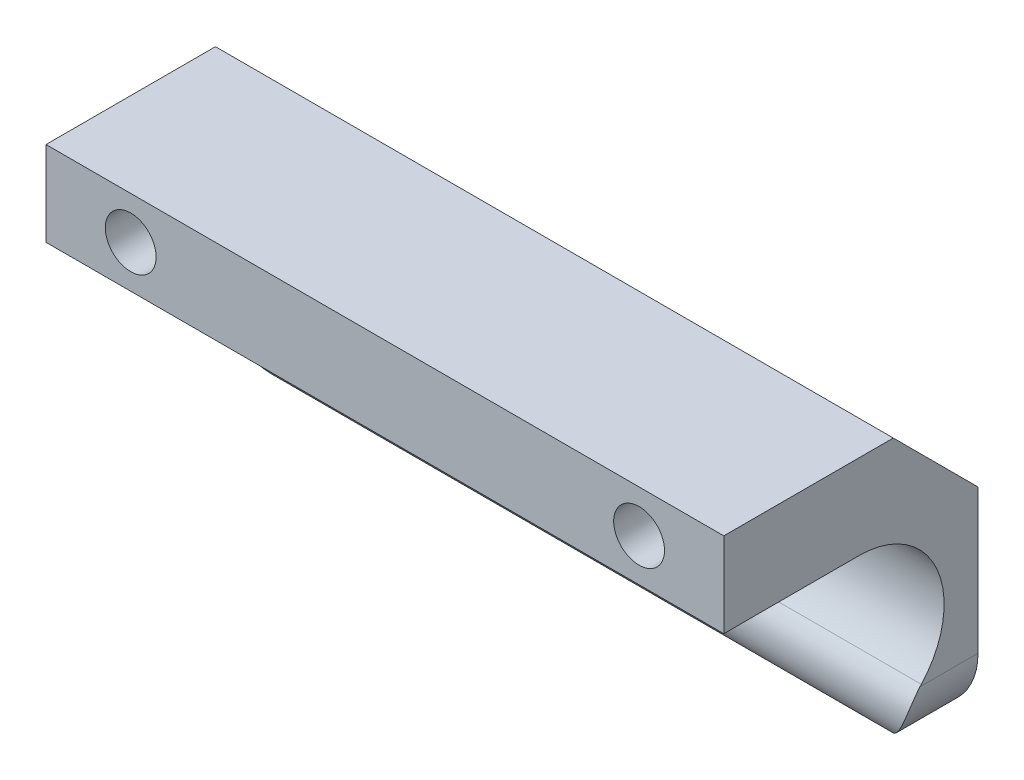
ISO-10303-21;
HEADER;
FILE_DESCRIPTION(('STEP AP214'),'2;1');
FILE_NAME('part.step','',(''),(''),'','','');
FILE_SCHEMA(('AUTOMOTIVE_DESIGN { 1 0 10303 214 1 1 1 1 }'));
ENDSEC;
DATA;
#1=APPLICATION_CONTEXT('core data for automotive mechanical design processes');
#2=APPLICATION_PROTOCOL_DEFINITION('international standard','automotive_design',2000,#1);
#3=PRODUCT_CONTEXT('',#1,'mechanical');
#4=PRODUCT('Part','Part','',(#3));
#5=PRODUCT_RELATED_PRODUCT_CATEGORY('part','',(#4));
#6=PRODUCT_DEFINITION_FORMATION('','',#4);
#7=PRODUCT_DEFINITION_CONTEXT('part definition',#1,'design');
#8=PRODUCT_DEFINITION('design','',#6,#7);
#9=PRODUCT_DEFINITION_SHAPE('','',#8);
#10=(LENGTH_UNIT() NAMED_UNIT(*) SI_UNIT(.MILLI.,.METRE.));
#11=(NAMED_UNIT(*) PLANE_ANGLE_UNIT() SI_UNIT($,.RADIAN.));
#12=(NAMED_UNIT(*) SI_UNIT($,.STERADIAN.) SOLID_ANGLE_UNIT());
#13=UNCERTAINTY_MEASURE_WITH_UNIT(LENGTH_MEASURE(1.E-05),#10,'distance_accuracy_value','');
#14=(GEOMETRIC_REPRESENTATION_CONTEXT(3) GLOBAL_UNCERTAINTY_ASSIGNED_CONTEXT((#13)) GLOBAL_UNIT_ASSIGNED_CONTEXT((#10,
#11,#12)) REPRESENTATION_CONTEXT('',''));
#15=CARTESIAN_POINT('',(0.,0.,0.));
#16=DIRECTION('',(0.,0.,1.));
#17=DIRECTION('',(1.,0.,0.));
#18=AXIS2_PLACEMENT_3D('',#15,#16,#17);
#19=CARTESIAN_POINT('',(-40.,17.5,-15.));
#20=DIRECTION('',(-1.,0.,0.));
#21=DIRECTION('',(0.,0.,1.));
#22=AXIS2_PLACEMENT_3D('',#19,#20,#21);
#23=PLANE('',#22);
#24=DIRECTION('',(0.,1.,0.));
#25=VECTOR('',#24,1.);
#26=CARTESIAN_POINT('',(-40.,-17.5,-15.));
#27=LINE('',#26,#25);
#28=CARTESIAN_POINT('',(-40.,-9.5,-15.));
#29=VERTEX_POINT('',#28);
#30=CARTESIAN_POINT('',(-40.,7.49999999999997,-15.));
#31=VERTEX_POINT('',#30);
#32=EDGE_CURVE('E203',#29,#31,#27,.T.);
#33=ORIENTED_EDGE('',*,*,#32,.F.);
#34=DIRECTION('',(0.,0.,-1.));
#35=VECTOR('',#34,1.);
#36=CARTESIAN_POINT('',(-40.,-9.5,15.));
#37=LINE('',#36,#35);
#38=CARTESIAN_POINT('',(-40.,-9.5,-8.15302564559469));
#39=VERTEX_POINT('',#38);
#40=EDGE_CURVE('E163',#39,#29,#37,.T.);
#41=ORIENTED_EDGE('',*,*,#40,.F.);
#42=CARTESIAN_POINT('',(-40.,-12.642135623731,-11.857864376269));
#43=DIRECTION('',(1.,0.,0.));
#44=DIRECTION('',(0.,0.,-1.));
#45=AXIS2_PLACEMENT_3D('',#42,#43,#44);
#46=CIRCLE('',#45,4.85786437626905);
#47=CARTESIAN_POINT('',(-40.,-9.32610593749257,-8.30782305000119));
#48=VERTEX_POINT('',#47);
#49=EDGE_CURVE('E177',#48,#39,#46,.T.);
#50=ORIENTED_EDGE('',*,*,#49,.F.);
#51=CARTESIAN_POINT('',(-40.,-2.5,-0.999999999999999));
#52=DIRECTION('',(1.,0.,0.));
#53=DIRECTION('',(0.,0.,-1.));
#54=AXIS2_PLACEMENT_3D('',#51,#52,#53);
#55=CIRCLE('',#54,10.);
#56=CARTESIAN_POINT('',(-40.,7.5,-1.));
#57=VERTEX_POINT('',#56);
#58=EDGE_CURVE('E181',#48,#57,#55,.T.);
#59=ORIENTED_EDGE('',*,*,#58,.T.);
#60=DIRECTION('',(0.,0.,1.));
#61=VECTOR('',#60,1.);
#62=CARTESIAN_POINT('',(-40.,7.5,-35.9970345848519));
#63=LINE('',#62,#61);
#64=CARTESIAN_POINT('',(-40.,7.5,15.));
#65=VERTEX_POINT('',#64);
#66=EDGE_CURVE('E186',#57,#65,#63,.T.);
#67=ORIENTED_EDGE('',*,*,#66,.T.);
#68=DIRECTION('',(0.,-1.,0.));
#69=VECTOR('',#68,1.);
#70=CARTESIAN_POINT('',(-40.,-17.5,15.));
#71=LINE('',#70,#69);
#72=CARTESIAN_POINT('',(-40.,17.5,15.));
#73=VERTEX_POINT('',#72);
#74=EDGE_CURVE('E213',#73,#65,#71,.T.);
#75=ORIENTED_EDGE('',*,*,#74,.F.);
#76=DIRECTION('',(0.,0.,1.));
#77=VECTOR('',#76,1.);
#78=CARTESIAN_POINT('',(-40.,17.5,15.));
#79=LINE('',#78,#77);
#80=CARTESIAN_POINT('',(-40.,17.5,-5.00000000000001));
#81=VERTEX_POINT('',#80);
#82=EDGE_CURVE('E223',#81,#73,#79,.T.);
#83=ORIENTED_EDGE('',*,*,#82,.F.);
#84=DIRECTION('',(0.,0.707106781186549,0.707106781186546));
#85=VECTOR('',#84,1.);
#86=CARTESIAN_POINT('',(-40.,12.5,-9.99999999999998));
#87=LINE('',#86,#85);
#88=EDGE_CURVE('E236',#81,#31,#87,.F.);
#89=ORIENTED_EDGE('',*,*,#88,.T.);
#90=EDGE_LOOP('',(#33,#41,#50,#59,#67,#75,#83,#89));
#91=FACE_BOUND('',#90,.T.);
#92=ADVANCED_FACE('F37',(#91),#23,.T.);
#93=CARTESIAN_POINT('',(40.,17.5,-15.));
#94=DIRECTION('',(-1.,0.,0.));
#95=DIRECTION('',(0.,0.,1.));
#96=AXIS2_PLACEMENT_3D('',#93,#94,#95);
#97=PLANE('',#96);
#98=DIRECTION('',(0.,0.,-1.));
#99=VECTOR('',#98,1.);
#100=CARTESIAN_POINT('',(40.,-9.5,15.));
#101=LINE('',#100,#99);
#102=CARTESIAN_POINT('',(40.,-9.5,-8.15302564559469));
#103=VERTEX_POINT('',#102);
#104=CARTESIAN_POINT('',(40.,-9.5,-15.));
#105=VERTEX_POINT('',#104);
#106=EDGE_CURVE('E169',#103,#105,#101,.T.);
#107=ORIENTED_EDGE('',*,*,#106,.T.);
#108=DIRECTION('',(0.,1.,0.));
#109=VECTOR('',#108,1.);
#110=CARTESIAN_POINT('',(40.,-17.5,-15.));
#111=LINE('',#110,#109);
#112=CARTESIAN_POINT('',(40.,7.49999999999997,-15.));
#113=VERTEX_POINT('',#112);
#114=EDGE_CURVE('E209',#105,#113,#111,.T.);
#115=ORIENTED_EDGE('',*,*,#114,.T.);
#116=DIRECTION('',(0.,-0.707106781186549,-0.707106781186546));
#117=VECTOR('',#116,1.);
#118=CARTESIAN_POINT('',(40.,17.5,-5.));
#119=LINE('',#118,#117);
#120=CARTESIAN_POINT('',(40.,17.5,-5.00000000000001));
#121=VERTEX_POINT('',#120);
#122=EDGE_CURVE('E244',#113,#121,#119,.F.);
#123=ORIENTED_EDGE('',*,*,#122,.T.);
#124=DIRECTION('',(0.,0.,1.));
#125=VECTOR('',#124,1.);
#126=CARTESIAN_POINT('',(40.,17.5,15.));
#127=LINE('',#126,#125);
#128=CARTESIAN_POINT('',(40.,17.5,15.));
#129=VERTEX_POINT('',#128);
#130=EDGE_CURVE('E212',#121,#129,#127,.T.);
#131=ORIENTED_EDGE('',*,*,#130,.T.);
#132=DIRECTION('',(0.,-1.,0.));
#133=VECTOR('',#132,1.);
#134=CARTESIAN_POINT('',(40.,-17.5,15.));
#135=LINE('',#134,#133);
#136=CARTESIAN_POINT('',(40.,7.5,15.));
#137=VERTEX_POINT('',#136);
#138=EDGE_CURVE('E216',#129,#137,#135,.T.);
#139=ORIENTED_EDGE('',*,*,#138,.T.);
#140=DIRECTION('',(0.,0.,1.));
#141=VECTOR('',#140,1.);
#142=CARTESIAN_POINT('',(40.,7.5,-35.9970345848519));
#143=LINE('',#142,#141);
#144=CARTESIAN_POINT('',(40.,7.5,-1.));
#145=VERTEX_POINT('',#144);
#146=EDGE_CURVE('E182',#145,#137,#143,.T.);
#147=ORIENTED_EDGE('',*,*,#146,.F.);
#148=CARTESIAN_POINT('',(40.,-2.5,-0.999999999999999));
#149=DIRECTION('',(1.,0.,0.));
#150=DIRECTION('',(0.,0.,-1.));
#151=AXIS2_PLACEMENT_3D('',#148,#149,#150);
#152=CIRCLE('',#151,10.);
#153=CARTESIAN_POINT('',(40.,-9.32610593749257,-8.30782305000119));
#154=VERTEX_POINT('',#153);
#155=EDGE_CURVE('E194',#154,#145,#152,.T.);
#156=ORIENTED_EDGE('',*,*,#155,.F.);
#157=CARTESIAN_POINT('',(40.,-12.642135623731,-11.857864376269));
#158=DIRECTION('',(1.,0.,0.));
#159=DIRECTION('',(0.,0.,-1.));
#160=AXIS2_PLACEMENT_3D('',#157,#158,#159);
#161=CIRCLE('',#160,4.85786437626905);
#162=EDGE_CURVE('E176',#154,#103,#161,.T.);
#163=ORIENTED_EDGE('',*,*,#162,.T.);
#164=EDGE_LOOP('',(#107,#115,#123,#131,#139,#147,#156,#163));
#165=FACE_BOUND('',#164,.T.);
#166=ADVANCED_FACE('F267',(#165),#97,.F.);
#167=CARTESIAN_POINT('',(40.,-17.5,-15.));
#168=DIRECTION('',(0.,0.,1.));
#169=DIRECTION('',(1.,0.,0.));
#170=AXIS2_PLACEMENT_3D('',#167,#168,#169);
#171=PLANE('',#170);
#172=DIRECTION('',(1.,0.,0.));
#173=VECTOR('',#172,1.);
#174=CARTESIAN_POINT('',(-40.,-16.3469743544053,-15.));
#175=LINE('',#174,#173);
#176=CARTESIAN_POINT('',(-36.1375043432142,-16.3469743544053,-15.));
#177=VERTEX_POINT('',#176);
#178=CARTESIAN_POINT('',(36.1375043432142,-16.3469743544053,-15.));
#179=VERTEX_POINT('',#178);
#180=EDGE_CURVE('E173',#177,#179,#175,.T.);
#181=ORIENTED_EDGE('',*,*,#180,.F.);
#182=CARTESIAN_POINT('',(-32.,-9.5,-15.));
#183=DIRECTION('',(0.,0.,1.));
#184=DIRECTION('',(-1.,0.,0.));
#185=AXIS2_PLACEMENT_3D('',#182,#183,#184);
#186=CIRCLE('',#185,8.);
#187=EDGE_CURVE('E160',#29,#177,#186,.T.);
#188=ORIENTED_EDGE('',*,*,#187,.F.);
#189=ORIENTED_EDGE('',*,*,#32,.T.);
#190=DIRECTION('',(1.,0.,0.));
#191=VECTOR('',#190,1.);
#192=CARTESIAN_POINT('',(40.,7.49999999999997,-15.));
#193=LINE('',#192,#191);
#194=EDGE_CURVE('E240',#31,#113,#193,.T.);
#195=ORIENTED_EDGE('',*,*,#194,.T.);
#196=ORIENTED_EDGE('',*,*,#114,.F.);
#197=CARTESIAN_POINT('',(32.,-9.5,-15.));
#198=DIRECTION('',(0.,0.,1.));
#199=DIRECTION('',(-1.,0.,0.));
#200=AXIS2_PLACEMENT_3D('',#197,#198,#199);
#201=CIRCLE('',#200,8.);
#202=EDGE_CURVE('E166',#179,#105,#201,.T.);
#203=ORIENTED_EDGE('',*,*,#202,.F.);
#204=EDGE_LOOP('',(#181,#188,#189,#195,#196,#203));
#205=FACE_BOUND('',#204,.T.);
#206=ADVANCED_FACE('F314',(#205),#171,.F.);
#207=CARTESIAN_POINT('',(40.,17.5,15.));
#208=DIRECTION('',(0.,-1.,0.));
#209=DIRECTION('',(0.,0.,-1.));
#210=AXIS2_PLACEMENT_3D('',#207,#208,#209);
#211=PLANE('',#210);
#212=ORIENTED_EDGE('',*,*,#130,.F.);
#213=DIRECTION('',(-1.,0.,0.));
#214=VECTOR('',#213,1.);
#215=CARTESIAN_POINT('',(40.,17.5,-5.));
#216=LINE('',#215,#214);
#217=EDGE_CURVE('E232',#121,#81,#216,.T.);
#218=ORIENTED_EDGE('',*,*,#217,.T.);
#219=ORIENTED_EDGE('',*,*,#82,.T.);
#220=DIRECTION('',(-1.,0.,0.));
#221=VECTOR('',#220,1.);
#222=CARTESIAN_POINT('',(40.,17.5,15.));
#223=LINE('',#222,#221);
#224=EDGE_CURVE('E220',#129,#73,#223,.T.);
#225=ORIENTED_EDGE('',*,*,#224,.F.);
#226=EDGE_LOOP('',(#212,#218,#219,#225));
#227=FACE_BOUND('',#226,.T.);
#228=ADVANCED_FACE('F321',(#227),#211,.F.);
#229=CARTESIAN_POINT('',(40.,-17.5,15.));
#230=DIRECTION('',(0.,0.,-1.));
#231=DIRECTION('',(-1.,0.,0.));
#232=AXIS2_PLACEMENT_3D('',#229,#230,#231);
#233=PLANE('',#232);
#234=CARTESIAN_POINT('',(30.,12.5,15.));
#235=DIRECTION('',(0.,0.,1.));
#236=DIRECTION('',(1.,0.,0.));
#237=AXIS2_PLACEMENT_3D('',#234,#235,#236);
#238=CIRCLE('',#237,3.);
#239=CARTESIAN_POINT('',(33.,12.5,15.));
#240=VERTEX_POINT('',#239);
#241=EDGE_CURVE('E353',#240,#240,#238,.T.);
#242=ORIENTED_EDGE('',*,*,#241,.F.);
#243=EDGE_LOOP('',(#242));
#244=FACE_BOUND('',#243,.T.);
#245=CARTESIAN_POINT('',(-30.,12.5,15.));
#246=DIRECTION('',(0.,0.,1.));
#247=DIRECTION('',(1.,0.,0.));
#248=AXIS2_PLACEMENT_3D('',#245,#246,#247);
#249=CIRCLE('',#248,3.);
#250=CARTESIAN_POINT('',(-27.,12.5,15.));
#251=VERTEX_POINT('',#250);
#252=EDGE_CURVE('E134',#251,#251,#249,.T.);
#253=ORIENTED_EDGE('',*,*,#252,.F.);
#254=EDGE_LOOP('',(#253));
#255=FACE_BOUND('',#254,.T.);
#256=ORIENTED_EDGE('',*,*,#74,.T.);
#257=DIRECTION('',(1.,0.,0.));
#258=VECTOR('',#257,1.);
#259=CARTESIAN_POINT('',(-40.,7.5,15.));
#260=LINE('',#259,#258);
#261=EDGE_CURVE('E200',#65,#137,#260,.T.);
#262=ORIENTED_EDGE('',*,*,#261,.T.);
#263=ORIENTED_EDGE('',*,*,#138,.F.);
#264=ORIENTED_EDGE('',*,*,#224,.T.);
#265=EDGE_LOOP('',(#256,#262,#263,#264));
#266=FACE_BOUND('',#265,.T.);
#267=ADVANCED_FACE('F318',(#244,#255,#266),#233,.F.);
#268=CARTESIAN_POINT('',(40.,17.5,-5.));
#269=DIRECTION('',(0.,-0.707106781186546,0.707106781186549));
#270=DIRECTION('',(0.,-0.707106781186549,-0.707106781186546));
#271=AXIS2_PLACEMENT_3D('',#268,#269,#270);
#272=PLANE('',#271);
#273=ORIENTED_EDGE('',*,*,#122,.F.);
#274=ORIENTED_EDGE('',*,*,#194,.F.);
#275=ORIENTED_EDGE('',*,*,#88,.F.);
#276=ORIENTED_EDGE('',*,*,#217,.F.);
#277=EDGE_LOOP('',(#273,#274,#275,#276));
#278=FACE_BOUND('',#277,.T.);
#279=ADVANCED_FACE('F39',(#278),#272,.F.);
#280=CARTESIAN_POINT('',(-40.,-12.642135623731,-11.857864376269));
#281=DIRECTION('',(1.,0.,0.));
#282=DIRECTION('',(0.,0.,-1.));
#283=AXIS2_PLACEMENT_3D('',#280,#281,#282);
#284=CYLINDRICAL_SURFACE('',#283,4.85786437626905);
#285=CARTESIAN_POINT('',(-36.1375043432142,-16.3469743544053,-15.));
#286=CARTESIAN_POINT('',(-36.0261493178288,-16.4142592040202,-14.9206561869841));
#287=CARTESIAN_POINT('',(-35.9139235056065,-16.4783721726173,-14.8399052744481));
#288=CARTESIAN_POINT('',(-35.6879480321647,-16.6003901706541,-14.6759350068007));
#289=CARTESIAN_POINT('',(-35.5741986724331,-16.6582964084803,-14.5927161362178));
#290=CARTESIAN_POINT('',(-35.2311071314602,-16.8228592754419,-14.3399621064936));
#291=CARTESIAN_POINT('',(-34.9997446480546,-16.9204660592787,-14.1672029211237));
#292=CARTESIAN_POINT('',(-34.5341663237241,-17.0920563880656,-13.8161969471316));
#293=CARTESIAN_POINT('',(-34.2999657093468,-17.1661334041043,-13.6379750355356));
#294=CARTESIAN_POINT('',(-33.8289391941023,-17.2919435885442,-13.2772338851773));
#295=CARTESIAN_POINT('',(-33.5921135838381,-17.3436792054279,-13.0947151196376));
#296=CARTESIAN_POINT('',(-33.1319730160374,-17.422727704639,-12.7387085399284));
#297=CARTESIAN_POINT('',(-32.9087578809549,-17.4513858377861,-12.5653856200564));
#298=CARTESIAN_POINT('',(-32.4617109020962,-17.4898128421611,-12.2176471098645));
#299=CARTESIAN_POINT('',(-32.2378795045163,-17.4995929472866,-12.0432322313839));
#300=CARTESIAN_POINT('',(-32.0094068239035,-17.4999958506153,-11.8651946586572));
#301=CARTESIAN_POINT('',(-32.0047033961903,-17.4999999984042,-11.8615295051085));
#302=CARTESIAN_POINT('',(-32.,-17.5,-11.857864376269));
#303=B_SPLINE_CURVE_WITH_KNOTS('',3,(#285,#286,#287,#288,#289,#290,#291,#292,#293,#294,#295,
#296,#297,#298,#299,#300,#301,#302),.UNSPECIFIED.,.F.,.F.,(4,2,2,2,2,2,2,2,4),(0.,
0.457072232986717,0.914055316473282,1.82729816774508,2.7368664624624,3.64633504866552,
4.49789854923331,5.34895514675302,5.36684369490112),.UNSPECIFIED.);
#304=CARTESIAN_POINT('',(-32.,-17.5,-11.857864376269));
#305=VERTEX_POINT('',#304);
#306=EDGE_CURVE('E11',#177,#305,#303,.T.);
#307=ORIENTED_EDGE('',*,*,#306,.F.);
#308=ORIENTED_EDGE('',*,*,#180,.T.);
#309=CARTESIAN_POINT('',(36.1375043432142,-16.3469743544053,-15.));
#310=CARTESIAN_POINT('',(36.0261493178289,-16.4142592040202,-14.9206561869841));
#311=CARTESIAN_POINT('',(35.9139235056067,-16.4783721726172,-14.8399052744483));
#312=CARTESIAN_POINT('',(35.6879480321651,-16.6003901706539,-14.675935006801));
#313=CARTESIAN_POINT('',(35.5741986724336,-16.65829640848,-14.5927161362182));
#314=CARTESIAN_POINT('',(35.231107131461,-16.8228592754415,-14.3399621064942));
#315=CARTESIAN_POINT('',(34.9997446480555,-16.9204660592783,-14.1672029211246));
#316=CARTESIAN_POINT('',(34.5341663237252,-17.0920563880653,-13.8161969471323));
#317=CARTESIAN_POINT('',(34.2999657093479,-17.1661334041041,-13.6379750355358));
#318=CARTESIAN_POINT('',(33.8289391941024,-17.2919435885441,-13.2772338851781));
#319=CARTESIAN_POINT('',(33.5921135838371,-17.3436792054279,-13.0947151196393));
#320=CARTESIAN_POINT('',(33.1319730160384,-17.422727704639,-12.7387085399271));
#321=CARTESIAN_POINT('',(32.9087578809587,-17.4513858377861,-12.5653856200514));
#322=CARTESIAN_POINT('',(32.4617109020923,-17.4898128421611,-12.2176471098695));
#323=CARTESIAN_POINT('',(32.2378795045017,-17.4995929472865,-12.0432322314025));
#324=CARTESIAN_POINT('',(32.0094068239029,-17.4999958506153,-11.865194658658));
#325=CARTESIAN_POINT('',(32.00470339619,-17.4999999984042,-11.8615295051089));
#326=CARTESIAN_POINT('',(32.,-17.5,-11.857864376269));
#327=B_SPLINE_CURVE_WITH_KNOTS('',3,(#309,#310,#311,#312,#313,#314,#315,#316,#317,#318,#319,
#320,#321,#322,#323,#324,#325,#326),.UNSPECIFIED.,.F.,.F.,(4,2,2,2,2,2,2,2,4),(0.,
0.457072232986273,0.914055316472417,1.82729816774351,2.73686646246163,3.64633504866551,
4.49789854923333,5.34895514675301,5.36684369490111),.UNSPECIFIED.);
#328=CARTESIAN_POINT('',(32.,-17.5,-11.857864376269));
#329=VERTEX_POINT('',#328);
#330=EDGE_CURVE('E246',#329,#179,#327,.F.);
#331=ORIENTED_EDGE('',*,*,#330,.F.);
#332=CARTESIAN_POINT('',(40.,-9.5,-8.15302564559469));
#333=CARTESIAN_POINT('',(40.0000097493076,-9.59352523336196,-8.07368202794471));
#334=CARTESIAN_POINT('',(39.9983604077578,-9.69008993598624,-7.99789663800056));
#335=CARTESIAN_POINT('',(39.9911711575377,-9.88859852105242,-7.85388207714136));
#336=CARTESIAN_POINT('',(39.9856301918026,-9.99054385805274,-7.78565496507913));
#337=CARTESIAN_POINT('',(39.9700913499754,-10.198972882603,-7.65729543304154));
#338=CARTESIAN_POINT('',(39.9600973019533,-10.3054526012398,-7.59715611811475));
#339=CARTESIAN_POINT('',(39.9351784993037,-10.52217077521,-7.48528386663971));
#340=CARTESIAN_POINT('',(39.9202543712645,-10.6324087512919,-7.43354986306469));
#341=CARTESIAN_POINT('',(39.8850588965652,-10.8559787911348,-7.33865317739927));
#342=CARTESIAN_POINT('',(39.8647759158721,-10.9693170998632,-7.29550950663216));
#343=CARTESIAN_POINT('',(39.8186122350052,-11.1979113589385,-7.21807659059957));
#344=CARTESIAN_POINT('',(39.7927294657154,-11.3131680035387,-7.1837906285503));
#345=CARTESIAN_POINT('',(39.735281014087,-11.5444077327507,-7.12414698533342));
#346=CARTESIAN_POINT('',(39.703722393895,-11.6603897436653,-7.09877832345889));
#347=CARTESIAN_POINT('',(39.6348944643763,-11.8922834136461,-7.05677505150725));
#348=CARTESIAN_POINT('',(39.5976230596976,-12.0081950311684,-7.04014365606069));
#349=CARTESIAN_POINT('',(39.51821752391,-12.2369330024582,-7.01558661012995));
#350=CARTESIAN_POINT('',(39.4761815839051,-12.34977757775,-7.00751149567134));
#351=CARTESIAN_POINT('',(39.386927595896,-12.5737336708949,-6.99918860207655));
#352=CARTESIAN_POINT('',(39.3397075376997,-12.6848444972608,-6.99894387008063));
#353=CARTESIAN_POINT('',(39.2403552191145,-12.9046752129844,-7.00585245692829));
#354=CARTESIAN_POINT('',(39.1882203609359,-13.0133938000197,-7.01300970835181));
#355=CARTESIAN_POINT('',(39.0793844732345,-13.2278389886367,-7.03423365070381));
#356=CARTESIAN_POINT('',(39.0226824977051,-13.3335649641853,-7.04830177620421));
#357=CARTESIAN_POINT('',(38.8837240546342,-13.5793186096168,-7.08909377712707));
#358=CARTESIAN_POINT('',(38.7996590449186,-13.7178767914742,-7.11855734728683));
#359=CARTESIAN_POINT('',(38.6246176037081,-13.9877993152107,-7.18801715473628));
#360=CARTESIAN_POINT('',(38.5336391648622,-14.1191615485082,-7.22801645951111));
#361=CARTESIAN_POINT('',(38.34555598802,-14.3743273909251,-7.31730842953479));
#362=CARTESIAN_POINT('',(38.2484445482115,-14.4981224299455,-7.36661138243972));
#363=CARTESIAN_POINT('',(38.0489770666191,-14.7377664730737,-7.47330173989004));
#364=CARTESIAN_POINT('',(37.9466195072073,-14.8536131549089,-7.53069149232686));
#365=CARTESIAN_POINT('',(37.6981722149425,-15.11917656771,-7.67530997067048));
#366=CARTESIAN_POINT('',(37.5500680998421,-15.2653178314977,-7.76566141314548));
#367=CARTESIAN_POINT('',(37.2469870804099,-15.5424592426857,-7.95717871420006));
#368=CARTESIAN_POINT('',(37.0920104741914,-15.6734600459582,-8.05834410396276));
#369=CARTESIAN_POINT('',(36.776167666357,-15.9209458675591,-8.2697202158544));
#370=CARTESIAN_POINT('',(36.615290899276,-16.0374030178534,-8.37994765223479));
#371=CARTESIAN_POINT('',(36.2890167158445,-16.2559526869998,-8.60762234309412));
#372=CARTESIAN_POINT('',(36.1236192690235,-16.3580451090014,-8.72506964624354));
#373=CARTESIAN_POINT('',(35.7251962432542,-16.5847491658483,-9.01187498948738));
#374=CARTESIAN_POINT('',(35.4904917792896,-16.7030468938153,-9.18391192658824));
#375=CARTESIAN_POINT('',(35.015925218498,-16.9142900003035,-9.53627860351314));
#376=CARTESIAN_POINT('',(34.7760611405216,-17.0072254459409,-9.71661156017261));
#377=CARTESIAN_POINT('',(34.2929259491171,-17.1685898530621,-10.0830184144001));
#378=CARTESIAN_POINT('',(34.0496584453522,-17.2370429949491,-10.2690864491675));
#379=CARTESIAN_POINT('',(33.5608069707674,-17.3502768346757,-10.6450941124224));
#380=CARTESIAN_POINT('',(33.3152234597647,-17.395062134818,-10.8350329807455));
#381=CARTESIAN_POINT('',(32.7182200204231,-17.4755446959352,-11.2982018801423));
#382=CARTESIAN_POINT('',(32.3660106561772,-17.4993671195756,-11.5726501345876));
#383=CARTESIAN_POINT('',(32.0094067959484,-17.4999958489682,-11.8505341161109));
#384=CARTESIAN_POINT('',(32.0047033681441,-17.4999999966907,-11.8541992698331));
#385=CARTESIAN_POINT('',(32.,-17.5,-11.857864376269));
#386=B_SPLINE_CURVE_WITH_KNOTS('',3,(#332,#333,#334,#335,#336,#337,#338,#339,#340,#341,#342,
#343,#344,#345,#346,#347,#348,#349,#350,#351,#352,#353,#354,#355,#356,#357,#358,#359,#360,#361,
#362,#363,#364,#365,#366,#367,#368,#369,#370,#371,#372,#373,#374,#375,#376,#377,#378,#379,#380,
#381,#382,#383,#384,#385),.UNSPECIFIED.,.F.,.F.,(4,2,2,2,2,2,2,2,2,2,2,2,2,2,2,2,2,2,2,2,2,2,2,
2,2,2,4),(0.,0.367866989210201,0.735833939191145,1.10348517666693,1.47108970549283,
1.83949895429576,2.2080445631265,2.57613474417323,2.94436025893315,3.30604174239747,
3.66786397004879,4.02987852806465,4.391968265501,4.88540779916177,5.37899115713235,
5.87312353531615,6.36739967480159,7.04689686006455,7.72636459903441,8.40711495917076,
9.08786990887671,10.0289002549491,10.9702986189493,11.9107646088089,12.8510476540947,
14.189414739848,14.2073032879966),.UNSPECIFIED.);
#387=EDGE_CURVE('E64',#103,#329,#386,.T.);
#388=ORIENTED_EDGE('',*,*,#387,.F.);
#389=ORIENTED_EDGE('',*,*,#162,.F.);
#390=DIRECTION('',(1.,0.,0.));
#391=VECTOR('',#390,1.);
#392=CARTESIAN_POINT('',(-40.,-9.32610593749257,-8.30782305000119));
#393=LINE('',#392,#391);
#394=EDGE_CURVE('E190',#48,#154,#393,.T.);
#395=ORIENTED_EDGE('',*,*,#394,.F.);
#396=ORIENTED_EDGE('',*,*,#49,.T.);
#397=CARTESIAN_POINT('',(-40.,-9.5,-8.15302564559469));
#398=CARTESIAN_POINT('',(-40.0000097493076,-9.59352523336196,-8.07368202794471));
#399=CARTESIAN_POINT('',(-39.9983604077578,-9.69008993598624,-7.99789663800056));
#400=CARTESIAN_POINT('',(-39.9911711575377,-9.88859852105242,-7.85388207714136));
#401=CARTESIAN_POINT('',(-39.9856301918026,-9.99054385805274,-7.78565496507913));
#402=CARTESIAN_POINT('',(-39.9700913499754,-10.198972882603,-7.65729543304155));
#403=CARTESIAN_POINT('',(-39.9600973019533,-10.3054526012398,-7.59715611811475));
#404=CARTESIAN_POINT('',(-39.9351784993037,-10.52217077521,-7.48528386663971));
#405=CARTESIAN_POINT('',(-39.9202543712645,-10.6324087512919,-7.43354986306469));
#406=CARTESIAN_POINT('',(-39.8850588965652,-10.8559787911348,-7.33865317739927));
#407=CARTESIAN_POINT('',(-39.8647759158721,-10.9693170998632,-7.29550950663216));
#408=CARTESIAN_POINT('',(-39.8186122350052,-11.1979113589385,-7.21807659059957));
#409=CARTESIAN_POINT('',(-39.7927294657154,-11.3131680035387,-7.1837906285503));
#410=CARTESIAN_POINT('',(-39.735281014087,-11.5444077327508,-7.12414698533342));
#411=CARTESIAN_POINT('',(-39.703722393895,-11.6603897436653,-7.09877832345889));
#412=CARTESIAN_POINT('',(-39.6348944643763,-11.8922834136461,-7.05677505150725));
#413=CARTESIAN_POINT('',(-39.5976230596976,-12.0081950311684,-7.04014365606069));
#414=CARTESIAN_POINT('',(-39.51821752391,-12.2369330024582,-7.01558661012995));
#415=CARTESIAN_POINT('',(-39.4761815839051,-12.34977757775,-7.00751149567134));
#416=CARTESIAN_POINT('',(-39.386927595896,-12.5737336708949,-6.99918860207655));
#417=CARTESIAN_POINT('',(-39.3397075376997,-12.6848444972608,-6.99894387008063));
#418=CARTESIAN_POINT('',(-39.2403552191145,-12.9046752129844,-7.00585245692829));
#419=CARTESIAN_POINT('',(-39.188220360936,-13.0133938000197,-7.01300970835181));
#420=CARTESIAN_POINT('',(-39.0793844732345,-13.2278389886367,-7.03423365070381));
#421=CARTESIAN_POINT('',(-39.0226824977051,-13.3335649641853,-7.04830177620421));
#422=CARTESIAN_POINT('',(-38.8837240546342,-13.5793186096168,-7.08909377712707));
#423=CARTESIAN_POINT('',(-38.7996590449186,-13.7178767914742,-7.11855734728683));
#424=CARTESIAN_POINT('',(-38.6246176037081,-13.9877993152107,-7.18801715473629));
#425=CARTESIAN_POINT('',(-38.5336391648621,-14.1191615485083,-7.22801645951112));
#426=CARTESIAN_POINT('',(-38.34555598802,-14.3743273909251,-7.3173084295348));
#427=CARTESIAN_POINT('',(-38.2484445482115,-14.4981224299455,-7.36661138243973));
#428=CARTESIAN_POINT('',(-38.0489770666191,-14.7377664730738,-7.47330173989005));
#429=CARTESIAN_POINT('',(-37.9466195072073,-14.8536131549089,-7.53069149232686));
#430=CARTESIAN_POINT('',(-37.6981722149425,-15.11917656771,-7.67530997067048));
#431=CARTESIAN_POINT('',(-37.5500680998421,-15.2653178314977,-7.76566141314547));
#432=CARTESIAN_POINT('',(-37.24698708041,-15.5424592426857,-7.95717871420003));
#433=CARTESIAN_POINT('',(-37.0920104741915,-15.6734600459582,-8.05834410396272));
#434=CARTESIAN_POINT('',(-36.7761676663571,-15.9209458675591,-8.26972021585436));
#435=CARTESIAN_POINT('',(-36.615290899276,-16.0374030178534,-8.37994765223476));
#436=CARTESIAN_POINT('',(-36.2890167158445,-16.2559526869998,-8.6076223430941));
#437=CARTESIAN_POINT('',(-36.1236192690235,-16.3580451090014,-8.72506964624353));
#438=CARTESIAN_POINT('',(-35.7251962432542,-16.5847491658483,-9.01187498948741));
#439=CARTESIAN_POINT('',(-35.4904917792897,-16.7030468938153,-9.18391192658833));
#440=CARTESIAN_POINT('',(-35.0159252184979,-16.9142900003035,-9.53627860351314));
#441=CARTESIAN_POINT('',(-34.7760611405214,-17.0072254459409,-9.71661156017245));
#442=CARTESIAN_POINT('',(-34.2929259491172,-17.1685898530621,-10.0830184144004));
#443=CARTESIAN_POINT('',(-34.0496584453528,-17.2370429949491,-10.2690864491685));
#444=CARTESIAN_POINT('',(-33.5608069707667,-17.3502768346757,-10.6450941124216));
#445=CARTESIAN_POINT('',(-33.3152234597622,-17.395062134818,-10.8350329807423));
#446=CARTESIAN_POINT('',(-32.7182200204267,-17.4755446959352,-11.298201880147));
#447=CARTESIAN_POINT('',(-32.3660106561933,-17.4993671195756,-11.5726501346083));
#448=CARTESIAN_POINT('',(-32.0094067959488,-17.4999958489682,-11.8505341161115));
#449=CARTESIAN_POINT('',(-32.0047033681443,-17.4999999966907,-11.8541992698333));
#450=CARTESIAN_POINT('',(-32.,-17.5,-11.857864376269));
#451=B_SPLINE_CURVE_WITH_KNOTS('',3,(#397,#398,#399,#400,#401,#402,#403,#404,#405,#406,#407,
#408,#409,#410,#411,#412,#413,#414,#415,#416,#417,#418,#419,#420,#421,#422,#423,#424,#425,#426,
#427,#428,#429,#430,#431,#432,#433,#434,#435,#436,#437,#438,#439,#440,#441,#442,#443,#444,#445,
#446,#447,#448,#449,#450),.UNSPECIFIED.,.F.,.F.,(4,2,2,2,2,2,2,2,2,2,2,2,2,2,2,2,2,2,2,2,2,2,2,
2,2,2,4),(0.,0.367866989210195,0.735833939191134,1.10348517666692,1.47108970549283,
1.83949895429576,2.2080445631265,2.57613474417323,2.94436025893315,3.30604174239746,
3.66786397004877,4.02987852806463,4.391968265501,4.88540779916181,5.37899115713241,
5.87312353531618,6.36739967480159,7.0468968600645,7.72636459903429,8.40711495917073,
9.08786990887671,10.0289002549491,10.9702986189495,11.9107646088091,12.8510476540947,
14.189414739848,14.2073032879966),.UNSPECIFIED.);
#452=EDGE_CURVE('E51',#305,#39,#451,.F.);
#453=ORIENTED_EDGE('',*,*,#452,.F.);
#454=EDGE_LOOP('',(#307,#308,#331,#388,#389,#395,#396,#453));
#455=FACE_BOUND('',#454,.T.);
#456=ADVANCED_FACE('F259',(#455),#284,.T.);
#457=CARTESIAN_POINT('',(-40.,7.5,-35.9970345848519));
#458=DIRECTION('',(0.,1.,0.));
#459=DIRECTION('',(0.,0.,1.));
#460=AXIS2_PLACEMENT_3D('',#457,#458,#459);
#461=PLANE('',#460);
#462=ORIENTED_EDGE('',*,*,#146,.T.);
#463=ORIENTED_EDGE('',*,*,#261,.F.);
#464=ORIENTED_EDGE('',*,*,#66,.F.);
#465=DIRECTION('',(1.,0.,0.));
#466=VECTOR('',#465,1.);
#467=CARTESIAN_POINT('',(-40.,7.5,-1.));
#468=LINE('',#467,#466);
#469=EDGE_CURVE('E204',#57,#145,#468,.T.);
#470=ORIENTED_EDGE('',*,*,#469,.T.);
#471=EDGE_LOOP('',(#462,#463,#464,#470));
#472=FACE_BOUND('',#471,.T.);
#473=ADVANCED_FACE('F264',(#472),#461,.F.);
#474=CARTESIAN_POINT('',(-40.,-2.5,-0.999999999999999));
#475=DIRECTION('',(1.,0.,0.));
#476=DIRECTION('',(0.,0.,-1.));
#477=AXIS2_PLACEMENT_3D('',#474,#475,#476);
#478=CYLINDRICAL_SURFACE('',#477,10.);
#479=ORIENTED_EDGE('',*,*,#155,.T.);
#480=ORIENTED_EDGE('',*,*,#469,.F.);
#481=ORIENTED_EDGE('',*,*,#58,.F.);
#482=ORIENTED_EDGE('',*,*,#394,.T.);
#483=EDGE_LOOP('',(#479,#480,#481,#482));
#484=FACE_BOUND('',#483,.T.);
#485=ADVANCED_FACE('F266',(#484),#478,.F.);
#486=CARTESIAN_POINT('',(32.,-9.5,15.));
#487=DIRECTION('',(0.,0.,-1.));
#488=DIRECTION('',(-1.,0.,0.));
#489=AXIS2_PLACEMENT_3D('',#486,#487,#488);
#490=CYLINDRICAL_SURFACE('',#489,8.);
#491=ORIENTED_EDGE('',*,*,#387,.T.);
#492=ORIENTED_EDGE('',*,*,#330,.T.);
#493=ORIENTED_EDGE('',*,*,#202,.T.);
#494=ORIENTED_EDGE('',*,*,#106,.F.);
#495=EDGE_LOOP('',(#491,#492,#493,#494));
#496=FACE_BOUND('',#495,.T.);
#497=ADVANCED_FACE('F256',(#496),#490,.T.);
#498=CARTESIAN_POINT('',(-32.,-9.5,15.));
#499=DIRECTION('',(0.,0.,-1.));
#500=DIRECTION('',(-1.,0.,0.));
#501=AXIS2_PLACEMENT_3D('',#498,#499,#500);
#502=CYLINDRICAL_SURFACE('',#501,8.);
#503=ORIENTED_EDGE('',*,*,#306,.T.);
#504=ORIENTED_EDGE('',*,*,#452,.T.);
#505=ORIENTED_EDGE('',*,*,#40,.T.);
#506=ORIENTED_EDGE('',*,*,#187,.T.);
#507=EDGE_LOOP('',(#503,#504,#505,#506));
#508=FACE_BOUND('',#507,.T.);
#509=ADVANCED_FACE('F276',(#508),#502,.T.);
#510=CARTESIAN_POINT('',(-30.,12.5,-2.));
#511=DIRECTION('',(0.,0.,1.));
#512=DIRECTION('',(1.,0.,0.));
#513=AXIS2_PLACEMENT_3D('',#510,#511,#512);
#514=CONICAL_SURFACE('',#513,2.5,1.02974425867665);
#515=CARTESIAN_POINT('',(-30.,12.5,-3.5021515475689));
#516=VERTEX_POINT('',#515);
#517=VERTEX_LOOP('',#516);
#518=FACE_BOUND('',#517,.T.);
#519=CARTESIAN_POINT('',(-30.,12.5,-2.));
#520=DIRECTION('',(0.,0.,1.));
#521=DIRECTION('',(1.,0.,0.));
#522=AXIS2_PLACEMENT_3D('',#519,#520,#521);
#523=CIRCLE('',#522,2.5);
#524=CARTESIAN_POINT('',(-27.5,12.5,-2.));
#525=VERTEX_POINT('',#524);
#526=EDGE_CURVE('E156',#525,#525,#523,.T.);
#527=ORIENTED_EDGE('',*,*,#526,.T.);
#528=EDGE_LOOP('',(#527));
#529=FACE_BOUND('',#528,.T.);
#530=ADVANCED_FACE('F280',(#518,#529),#514,.F.);
#531=CARTESIAN_POINT('',(-30.,12.5,15.));
#532=DIRECTION('',(0.,0.,1.));
#533=DIRECTION('',(1.,0.,0.));
#534=AXIS2_PLACEMENT_3D('',#531,#532,#533);
#535=CYLINDRICAL_SURFACE('',#534,2.5);
#536=ORIENTED_EDGE('',*,*,#526,.F.);
#537=EDGE_LOOP('',(#536));
#538=FACE_BOUND('',#537,.T.);
#539=CARTESIAN_POINT('',(-30.,12.5,3.));
#540=DIRECTION('',(0.,0.,1.));
#541=DIRECTION('',(1.,0.,0.));
#542=AXIS2_PLACEMENT_3D('',#539,#540,#541);
#543=CIRCLE('',#542,2.5);
#544=CARTESIAN_POINT('',(-27.5,12.5,3.));
#545=VERTEX_POINT('',#544);
#546=EDGE_CURVE('E152',#545,#545,#543,.T.);
#547=ORIENTED_EDGE('',*,*,#546,.T.);
#548=EDGE_LOOP('',(#547));
#549=FACE_BOUND('',#548,.T.);
#550=ADVANCED_FACE('F284',(#538,#549),#535,.F.);
#551=CARTESIAN_POINT('',(-27.5,12.5,3.));
#552=DIRECTION('',(0.,0.,-1.));
#553=DIRECTION('',(-1.,0.,0.));
#554=AXIS2_PLACEMENT_3D('',#551,#552,#553);
#555=PLANE('',#554);
#556=ORIENTED_EDGE('',*,*,#546,.F.);
#557=EDGE_LOOP('',(#556));
#558=FACE_BOUND('',#557,.T.);
#559=CARTESIAN_POINT('',(-30.,12.5,3.));
#560=DIRECTION('',(0.,0.,1.));
#561=DIRECTION('',(1.,0.,0.));
#562=AXIS2_PLACEMENT_3D('',#559,#560,#561);
#563=CIRCLE('',#562,3.);
#564=CARTESIAN_POINT('',(-27.,12.5,3.));
#565=VERTEX_POINT('',#564);
#566=EDGE_CURVE('E141',#565,#565,#563,.T.);
#567=ORIENTED_EDGE('',*,*,#566,.T.);
#568=EDGE_LOOP('',(#567));
#569=FACE_BOUND('',#568,.T.);
#570=ADVANCED_FACE('F288',(#558,#569),#555,.F.);
#571=CARTESIAN_POINT('',(-30.,12.5,15.));
#572=DIRECTION('',(0.,0.,1.));
#573=DIRECTION('',(1.,0.,0.));
#574=AXIS2_PLACEMENT_3D('',#571,#572,#573);
#575=CYLINDRICAL_SURFACE('',#574,3.);
#576=ORIENTED_EDGE('',*,*,#566,.F.);
#577=EDGE_LOOP('',(#576));
#578=FACE_BOUND('',#577,.T.);
#579=ORIENTED_EDGE('',*,*,#252,.T.);
#580=EDGE_LOOP('',(#579));
#581=FACE_BOUND('',#580,.T.);
#582=ADVANCED_FACE('F127',(#578,#581),#575,.F.);
#583=CARTESIAN_POINT('',(30.,12.5,-2.));
#584=DIRECTION('',(0.,0.,1.));
#585=DIRECTION('',(1.,0.,0.));
#586=AXIS2_PLACEMENT_3D('',#583,#584,#585);
#587=CONICAL_SURFACE('',#586,2.5,1.02974425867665);
#588=CARTESIAN_POINT('',(30.,12.5,-3.5021515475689));
#589=VERTEX_POINT('',#588);
#590=VERTEX_LOOP('',#589);
#591=FACE_BOUND('',#590,.T.);
#592=CARTESIAN_POINT('',(30.,12.5,-2.));
#593=DIRECTION('',(0.,0.,1.));
#594=DIRECTION('',(1.,0.,0.));
#595=AXIS2_PLACEMENT_3D('',#592,#593,#594);
#596=CIRCLE('',#595,2.5);
#597=CARTESIAN_POINT('',(32.5,12.5,-2.));
#598=VERTEX_POINT('',#597);
#599=EDGE_CURVE('E131',#598,#598,#596,.T.);
#600=ORIENTED_EDGE('',*,*,#599,.T.);
#601=EDGE_LOOP('',(#600));
#602=FACE_BOUND('',#601,.T.);
#603=ADVANCED_FACE('F123',(#591,#602),#587,.F.);
#604=CARTESIAN_POINT('',(30.,12.5,15.));
#605=DIRECTION('',(0.,0.,1.));
#606=DIRECTION('',(1.,0.,0.));
#607=AXIS2_PLACEMENT_3D('',#604,#605,#606);
#608=CYLINDRICAL_SURFACE('',#607,2.5);
#609=ORIENTED_EDGE('',*,*,#599,.F.);
#610=EDGE_LOOP('',(#609));
#611=FACE_BOUND('',#610,.T.);
#612=CARTESIAN_POINT('',(30.,12.5,3.));
#613=DIRECTION('',(0.,0.,1.));
#614=DIRECTION('',(1.,0.,0.));
#615=AXIS2_PLACEMENT_3D('',#612,#613,#614);
#616=CIRCLE('',#615,2.5);
#617=CARTESIAN_POINT('',(32.5,12.5,3.));
#618=VERTEX_POINT('',#617);
#619=EDGE_CURVE('E135',#618,#618,#616,.T.);
#620=ORIENTED_EDGE('',*,*,#619,.T.);
#621=EDGE_LOOP('',(#620));
#622=FACE_BOUND('',#621,.T.);
#623=ADVANCED_FACE('F126',(#611,#622),#608,.F.);
#624=CARTESIAN_POINT('',(32.5,12.5,3.));
#625=DIRECTION('',(0.,0.,-1.));
#626=DIRECTION('',(-1.,0.,0.));
#627=AXIS2_PLACEMENT_3D('',#624,#625,#626);
#628=PLANE('',#627);
#629=ORIENTED_EDGE('',*,*,#619,.F.);
#630=EDGE_LOOP('',(#629));
#631=FACE_BOUND('',#630,.T.);
#632=CARTESIAN_POINT('',(30.,12.5,3.));
#633=DIRECTION('',(0.,0.,1.));
#634=DIRECTION('',(1.,0.,0.));
#635=AXIS2_PLACEMENT_3D('',#632,#633,#634);
#636=CIRCLE('',#635,3.);
#637=CARTESIAN_POINT('',(33.,12.5,3.));
#638=VERTEX_POINT('',#637);
#639=EDGE_CURVE('E145',#638,#638,#636,.T.);
#640=ORIENTED_EDGE('',*,*,#639,.T.);
#641=EDGE_LOOP('',(#640));
#642=FACE_BOUND('',#641,.T.);
#643=ADVANCED_FACE('F298',(#631,#642),#628,.F.);
#644=CARTESIAN_POINT('',(30.,12.5,15.));
#645=DIRECTION('',(0.,0.,1.));
#646=DIRECTION('',(1.,0.,0.));
#647=AXIS2_PLACEMENT_3D('',#644,#645,#646);
#648=CYLINDRICAL_SURFACE('',#647,3.);
#649=ORIENTED_EDGE('',*,*,#639,.F.);
#650=EDGE_LOOP('',(#649));
#651=FACE_BOUND('',#650,.T.);
#652=ORIENTED_EDGE('',*,*,#241,.T.);
#653=EDGE_LOOP('',(#652));
#654=FACE_BOUND('',#653,.T.);
#655=ADVANCED_FACE('F301',(#651,#654),#648,.F.);
#656=CLOSED_SHELL('',(#92,#166,#206,#228,#267,#279,#456,#473,#485,#497,#509,#530,#550,#570,#582,
#603,#623,#643,#655));
#657=MANIFOLD_SOLID_BREP('B2',#656);
#658=ADVANCED_BREP_SHAPE_REPRESENTATION('',(#18,#657),#14);
#659=SHAPE_DEFINITION_REPRESENTATION(#9,#658);
ENDSEC;
END-ISO-10303-21;
